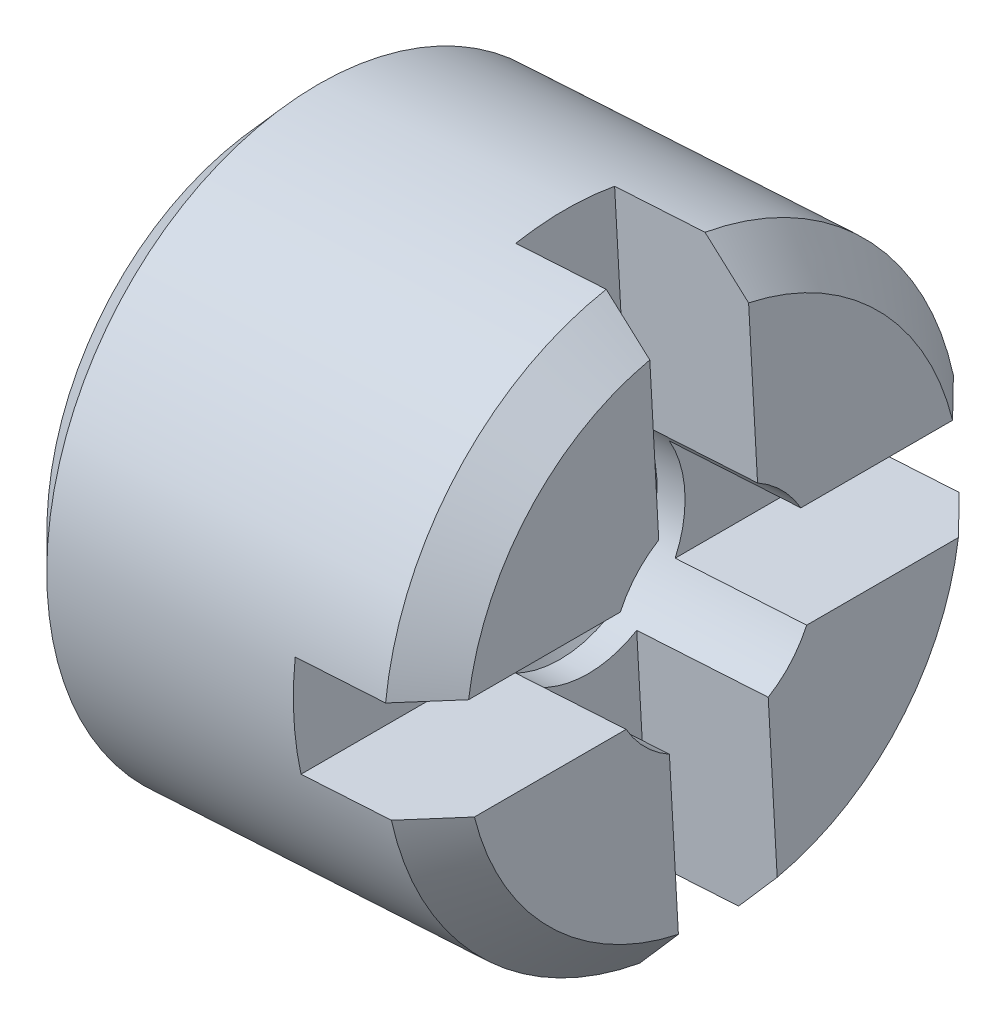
ISO-10303-21;
HEADER;
FILE_DESCRIPTION(('STEP AP214'),'2;1');
FILE_NAME('part.step','',(''),(''),'','','');
FILE_SCHEMA(('AUTOMOTIVE_DESIGN { 1 0 10303 214 1 1 1 1 }'));
ENDSEC;
DATA;
#1=APPLICATION_CONTEXT('core data for automotive mechanical design processes');
#2=APPLICATION_PROTOCOL_DEFINITION('international standard','automotive_design',2000,#1);
#3=PRODUCT_CONTEXT('',#1,'mechanical');
#4=PRODUCT('Part','Part','',(#3));
#5=PRODUCT_RELATED_PRODUCT_CATEGORY('part','',(#4));
#6=PRODUCT_DEFINITION_FORMATION('','',#4);
#7=PRODUCT_DEFINITION_CONTEXT('part definition',#1,'design');
#8=PRODUCT_DEFINITION('design','',#6,#7);
#9=PRODUCT_DEFINITION_SHAPE('','',#8);
#10=(LENGTH_UNIT() NAMED_UNIT(*) SI_UNIT(.MILLI.,.METRE.));
#11=(NAMED_UNIT(*) PLANE_ANGLE_UNIT() SI_UNIT($,.RADIAN.));
#12=(NAMED_UNIT(*) SI_UNIT($,.STERADIAN.) SOLID_ANGLE_UNIT());
#13=UNCERTAINTY_MEASURE_WITH_UNIT(LENGTH_MEASURE(1.E-05),#10,'distance_accuracy_value','');
#14=(GEOMETRIC_REPRESENTATION_CONTEXT(3) GLOBAL_UNCERTAINTY_ASSIGNED_CONTEXT((#13)) GLOBAL_UNIT_ASSIGNED_CONTEXT((#10,
#11,#12)) REPRESENTATION_CONTEXT('',''));
#15=CARTESIAN_POINT('',(0.,0.,0.));
#16=DIRECTION('',(0.,0.,1.));
#17=DIRECTION('',(1.,0.,0.));
#18=AXIS2_PLACEMENT_3D('',#15,#16,#17);
#19=CARTESIAN_POINT('',(13.2898777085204,21.6295561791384,0.));
#20=DIRECTION('',(0.998253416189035,0.0590772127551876,0.));
#21=DIRECTION('',(-0.0590772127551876,0.998253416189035,0.));
#22=AXIS2_PLACEMENT_3D('',#19,#20,#21);
#23=CONICAL_SURFACE('',#22,1.2499999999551,1.04719754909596);
#24=CARTESIAN_POINT('',(13.2898777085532,21.6295561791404,0.));
#25=DIRECTION('',(-0.998253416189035,-0.059077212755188,0.));
#26=DIRECTION('',(0.059077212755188,-0.998253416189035,0.));
#27=AXIS2_PLACEMENT_3D('',#24,#25,#26);
#28=CIRCLE('',#27,1.25);
#29=CARTESIAN_POINT('',(13.3637242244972,20.3817394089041,0.));
#30=VERTEX_POINT('',#29);
#31=EDGE_CURVE('E417',#30,#30,#28,.F.);
#32=ORIENTED_EDGE('',*,*,#31,.T.);
#33=EDGE_LOOP('',(#32));
#34=FACE_BOUND('',#33,.T.);
#35=CARTESIAN_POINT('',(12.569450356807,21.5869208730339,0.));
#36=VERTEX_POINT('',#35);
#37=VERTEX_LOOP('',#36);
#38=FACE_BOUND('',#37,.T.);
#39=ADVANCED_FACE('F16',(#34,#38),#23,.F.);
#40=CARTESIAN_POINT('',(14.2593140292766,21.6869279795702,0.));
#41=DIRECTION('',(-0.998253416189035,-0.059077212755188,0.));
#42=DIRECTION('',(0.059077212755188,-0.998253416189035,0.));
#43=AXIS2_PLACEMENT_3D('',#40,#41,#42);
#44=CYLINDRICAL_SURFACE('',#43,1.25);
#45=DIRECTION('',(-0.998253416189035,-0.059077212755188,0.));
#46=VECTOR('',#45,1.);
#47=CARTESIAN_POINT('',(14.1945308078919,22.7815983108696,-0.599999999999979));
#48=LINE('',#47,#46);
#49=CARTESIAN_POINT('',(13.5667616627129,22.7444465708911,-0.599999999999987));
#50=VERTEX_POINT('',#49);
#51=CARTESIAN_POINT('',(15.1639671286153,22.8389701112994,-0.599999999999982));
#52=VERTEX_POINT('',#51);
#53=EDGE_CURVE('E165',#50,#52,#48,.F.);
#54=ORIENTED_EDGE('',*,*,#53,.F.);
#55=CARTESIAN_POINT('',(13.6315448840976,21.6497762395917,0.));
#56=DIRECTION('',(-0.998253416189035,-0.059077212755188,0.));
#57=DIRECTION('',(0.059077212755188,-0.998253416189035,0.));
#58=AXIS2_PLACEMENT_3D('',#55,#56,#57);
#59=CIRCLE('',#58,1.25);
#60=CARTESIAN_POINT('',(13.5667616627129,22.7444465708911,0.600000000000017));
#61=VERTEX_POINT('',#60);
#62=EDGE_CURVE('E416',#61,#50,#59,.T.);
#63=ORIENTED_EDGE('',*,*,#62,.F.);
#64=DIRECTION('',(-0.998253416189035,-0.059077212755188,0.));
#65=VECTOR('',#64,1.);
#66=CARTESIAN_POINT('',(14.1945308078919,22.7815983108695,0.600000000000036));
#67=LINE('',#66,#65);
#68=CARTESIAN_POINT('',(15.1639671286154,22.8389701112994,0.600000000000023));
#69=VERTEX_POINT('',#68);
#70=EDGE_CURVE('E414',#69,#61,#67,.T.);
#71=ORIENTED_EDGE('',*,*,#70,.F.);
#72=CARTESIAN_POINT('',(15.22875035,21.74429978,0.));
#73=DIRECTION('',(-0.998253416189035,-0.059077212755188,0.));
#74=DIRECTION('',(0.059077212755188,-0.998253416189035,0.));
#75=AXIS2_PLACEMENT_3D('',#72,#73,#74);
#76=CIRCLE('',#75,1.25);
#77=CARTESIAN_POINT('',(15.1933040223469,22.3432518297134,1.09658560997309));
#78=VERTEX_POINT('',#77);
#79=EDGE_CURVE('E412',#78,#69,#76,.T.);
#80=ORIENTED_EDGE('',*,*,#79,.F.);
#81=DIRECTION('',(-0.998253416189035,-0.059077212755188,0.));
#82=VECTOR('',#81,1.);
#83=CARTESIAN_POINT('',(14.2238677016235,22.2858800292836,1.09658560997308));
#84=LINE('',#83,#82);
#85=CARTESIAN_POINT('',(13.5960985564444,22.2487282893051,1.09658560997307));
#86=VERTEX_POINT('',#85);
#87=EDGE_CURVE('E410',#86,#78,#84,.F.);
#88=ORIENTED_EDGE('',*,*,#87,.F.);
#89=CARTESIAN_POINT('',(13.6315448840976,21.6497762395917,0.));
#90=DIRECTION('',(-0.998253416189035,-0.059077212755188,0.));
#91=DIRECTION('',(0.059077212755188,-0.998253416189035,0.));
#92=AXIS2_PLACEMENT_3D('',#89,#90,#91);
#93=CIRCLE('',#92,1.25);
#94=CARTESIAN_POINT('',(13.6669912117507,21.0508241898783,1.09658560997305));
#95=VERTEX_POINT('',#94);
#96=EDGE_CURVE('E419',#95,#86,#93,.T.);
#97=ORIENTED_EDGE('',*,*,#96,.F.);
#98=DIRECTION('',(-0.998253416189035,-0.059077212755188,0.));
#99=VECTOR('',#98,1.);
#100=CARTESIAN_POINT('',(14.4655939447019,21.0980859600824,1.09658560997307));
#101=LINE('',#100,#99);
#102=CARTESIAN_POINT('',(15.2641966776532,21.1453477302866,1.09658560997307));
#103=VERTEX_POINT('',#102);
#104=EDGE_CURVE('E386',#103,#95,#101,.T.);
#105=ORIENTED_EDGE('',*,*,#104,.F.);
#106=CARTESIAN_POINT('',(15.22875035,21.74429978,0.));
#107=DIRECTION('',(-0.998253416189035,-0.059077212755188,0.));
#108=DIRECTION('',(0.059077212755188,-0.998253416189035,0.));
#109=AXIS2_PLACEMENT_3D('',#106,#107,#108);
#110=CIRCLE('',#109,1.25);
#111=CARTESIAN_POINT('',(15.2935335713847,20.6496294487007,0.60000000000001));
#112=VERTEX_POINT('',#111);
#113=EDGE_CURVE('E413',#112,#103,#110,.T.);
#114=ORIENTED_EDGE('',*,*,#113,.F.);
#115=DIRECTION('',(0.998253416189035,0.0590772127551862,0.));
#116=VECTOR('',#115,1.);
#117=CARTESIAN_POINT('',(13.6963281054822,20.5551059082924,0.60000000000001));
#118=LINE('',#117,#116);
#119=CARTESIAN_POINT('',(13.6963281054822,20.5551059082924,0.60000000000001));
#120=VERTEX_POINT('',#119);
#121=EDGE_CURVE('E326',#120,#112,#118,.T.);
#122=ORIENTED_EDGE('',*,*,#121,.F.);
#123=CARTESIAN_POINT('',(13.6315448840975,21.6497762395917,0.));
#124=DIRECTION('',(-0.998253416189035,-0.059077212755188,0.));
#125=DIRECTION('',(0.059077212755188,-0.998253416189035,0.));
#126=AXIS2_PLACEMENT_3D('',#123,#124,#125);
#127=CIRCLE('',#126,1.25);
#128=CARTESIAN_POINT('',(13.6963281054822,20.5551059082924,-0.599999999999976));
#129=VERTEX_POINT('',#128);
#130=EDGE_CURVE('E420',#129,#120,#127,.T.);
#131=ORIENTED_EDGE('',*,*,#130,.F.);
#132=DIRECTION('',(-0.998253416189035,-0.059077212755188,0.));
#133=VECTOR('',#132,1.);
#134=CARTESIAN_POINT('',(14.3240972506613,20.5922576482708,-0.599999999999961));
#135=LINE('',#134,#133);
#136=CARTESIAN_POINT('',(15.2935335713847,20.6496294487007,-0.599999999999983));
#137=VERTEX_POINT('',#136);
#138=EDGE_CURVE('E366',#137,#129,#135,.T.);
#139=ORIENTED_EDGE('',*,*,#138,.F.);
#140=CARTESIAN_POINT('',(15.22875035,21.74429978,0.));
#141=DIRECTION('',(-0.998253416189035,-0.059077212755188,0.));
#142=DIRECTION('',(0.059077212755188,-0.998253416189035,0.));
#143=AXIS2_PLACEMENT_3D('',#140,#141,#142);
#144=CIRCLE('',#143,1.25);
#145=CARTESIAN_POINT('',(15.2641966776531,21.1453477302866,-1.09658560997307));
#146=VERTEX_POINT('',#145);
#147=EDGE_CURVE('E421',#146,#137,#144,.T.);
#148=ORIENTED_EDGE('',*,*,#147,.F.);
#149=DIRECTION('',(-0.998253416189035,-0.059077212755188,0.));
#150=VECTOR('',#149,1.);
#151=CARTESIAN_POINT('',(14.2947603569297,21.0879759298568,-1.09658560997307));
#152=LINE('',#151,#150);
#153=CARTESIAN_POINT('',(13.6669912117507,21.0508241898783,-1.09658560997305));
#154=VERTEX_POINT('',#153);
#155=EDGE_CURVE('E180',#154,#146,#152,.F.);
#156=ORIENTED_EDGE('',*,*,#155,.F.);
#157=CARTESIAN_POINT('',(13.6315448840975,21.6497762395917,0.));
#158=DIRECTION('',(-0.998253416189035,-0.059077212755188,0.));
#159=DIRECTION('',(0.059077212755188,-0.998253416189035,0.));
#160=AXIS2_PLACEMENT_3D('',#157,#158,#159);
#161=CIRCLE('',#160,1.25);
#162=CARTESIAN_POINT('',(13.5960985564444,22.2487282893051,-1.09658560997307));
#163=VERTEX_POINT('',#162);
#164=EDGE_CURVE('E178',#163,#154,#161,.T.);
#165=ORIENTED_EDGE('',*,*,#164,.F.);
#166=DIRECTION('',(-0.998253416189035,-0.059077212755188,0.));
#167=VECTOR('',#166,1.);
#168=CARTESIAN_POINT('',(14.2238677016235,22.2858800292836,-1.09658560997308));
#169=LINE('',#168,#167);
#170=CARTESIAN_POINT('',(15.1933040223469,22.3432518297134,-1.09658560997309));
#171=VERTEX_POINT('',#170);
#172=EDGE_CURVE('E164',#171,#163,#169,.T.);
#173=ORIENTED_EDGE('',*,*,#172,.F.);
#174=CARTESIAN_POINT('',(15.22875035,21.74429978,0.));
#175=DIRECTION('',(-0.998253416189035,-0.059077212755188,0.));
#176=DIRECTION('',(0.059077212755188,-0.998253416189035,0.));
#177=AXIS2_PLACEMENT_3D('',#174,#175,#176);
#178=CIRCLE('',#177,1.25);
#179=EDGE_CURVE('E19',#52,#171,#178,.T.);
#180=ORIENTED_EDGE('',*,*,#179,.F.);
#181=EDGE_LOOP('',(#54,#63,#71,#80,#88,#97,#105,#114,#122,#131,#139,#148,#156,#165,#173,#180));
#182=FACE_BOUND('',#181,.T.);
#183=ORIENTED_EDGE('',*,*,#31,.F.);
#184=EDGE_LOOP('',(#183));
#185=FACE_BOUND('',#184,.T.);
#186=ADVANCED_FACE('F175',(#182,#185),#44,.F.);
#187=CARTESIAN_POINT('',(13.6315448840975,21.6497762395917,0.));
#188=DIRECTION('',(0.998253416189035,0.059077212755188,0.));
#189=DIRECTION('',(-0.059077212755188,0.998253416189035,0.));
#190=AXIS2_PLACEMENT_3D('',#187,#188,#189);
#191=PLANE('',#190);
#192=CARTESIAN_POINT('',(13.6315448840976,21.6497762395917,0.));
#193=DIRECTION('',(-0.998253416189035,-0.059077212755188,0.));
#194=DIRECTION('',(0.059077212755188,-0.998253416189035,0.));
#195=AXIS2_PLACEMENT_3D('',#192,#193,#194);
#196=CIRCLE('',#195,3.5);
#197=CARTESIAN_POINT('',(13.5960985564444,22.2487282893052,3.44818792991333));
#198=VERTEX_POINT('',#197);
#199=CARTESIAN_POINT('',(13.6669912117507,21.0508241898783,3.44818792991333));
#200=VERTEX_POINT('',#199);
#201=EDGE_CURVE('E327',#198,#200,#196,.F.);
#202=ORIENTED_EDGE('',*,*,#201,.T.);
#203=DIRECTION('',(0.,0.,1.));
#204=VECTOR('',#203,1.);
#205=CARTESIAN_POINT('',(13.6669912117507,21.0508241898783,0.));
#206=LINE('',#205,#204);
#207=EDGE_CURVE('E389',#95,#200,#206,.T.);
#208=ORIENTED_EDGE('',*,*,#207,.F.);
#209=ORIENTED_EDGE('',*,*,#96,.T.);
#210=DIRECTION('',(0.,0.,1.));
#211=VECTOR('',#210,1.);
#212=CARTESIAN_POINT('',(13.5960985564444,22.2487282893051,0.));
#213=LINE('',#212,#211);
#214=EDGE_CURVE('E398',#198,#86,#213,.F.);
#215=ORIENTED_EDGE('',*,*,#214,.F.);
#216=EDGE_LOOP('',(#202,#208,#209,#215));
#217=FACE_BOUND('',#216,.T.);
#218=ADVANCED_FACE('F334',(#217),#191,.T.);
#219=CARTESIAN_POINT('',(14.4301476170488,21.6970380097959,0.60000000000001));
#220=DIRECTION('',(0.,0.,-1.));
#221=DIRECTION('',(-1.,0.,0.));
#222=AXIS2_PLACEMENT_3D('',#219,#220,#221);
#223=PLANE('',#222);
#224=DIRECTION('',(-0.998253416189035,-0.0590772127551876,0.));
#225=VECTOR('',#224,1.);
#226=CARTESIAN_POINT('',(14.9333329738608,18.2725957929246,0.60000000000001));
#227=LINE('',#226,#225);
#228=CARTESIAN_POINT('',(14.9333329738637,18.2725957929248,0.60000000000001));
#229=VERTEX_POINT('',#228);
#230=CARTESIAN_POINT('',(13.8352542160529,18.2076108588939,0.60000000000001));
#231=VERTEX_POINT('',#230);
#232=EDGE_CURVE('E325',#229,#231,#227,.T.);
#233=ORIENTED_EDGE('',*,*,#232,.T.);
#234=DIRECTION('',(-0.059077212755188,0.998253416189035,0.));
#235=VECTOR('',#234,1.);
#236=CARTESIAN_POINT('',(13.6315448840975,21.6497762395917,0.60000000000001));
#237=LINE('',#236,#235);
#238=EDGE_CURVE('E370',#120,#231,#237,.F.);
#239=ORIENTED_EDGE('',*,*,#238,.F.);
#240=ORIENTED_EDGE('',*,*,#121,.T.);
#241=DIRECTION('',(-0.059077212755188,0.998253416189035,0.));
#242=VECTOR('',#241,1.);
#243=CARTESIAN_POINT('',(15.3542894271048,19.6230112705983,0.60000000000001));
#244=LINE('',#243,#242);
#245=CARTESIAN_POINT('',(15.402401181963,18.8100459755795,0.60000000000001));
#246=VERTEX_POINT('',#245);
#247=EDGE_CURVE('E457',#246,#112,#244,.T.);
#248=ORIENTED_EDGE('',*,*,#247,.F.);
#249=CARTESIAN_POINT('',(15.4024011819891,18.8100459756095,0.60000000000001));
#250=CARTESIAN_POINT('',(15.324345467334,18.720364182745,0.60000000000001));
#251=CARTESIAN_POINT('',(15.2462285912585,18.6307357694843,0.60000000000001));
#252=CARTESIAN_POINT('',(15.0898725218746,18.4515857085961,0.60000000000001));
#253=CARTESIAN_POINT('',(15.011633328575,18.3620640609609,0.60000000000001));
#254=CARTESIAN_POINT('',(14.9333329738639,18.2725957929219,0.60000000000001));
#255=B_SPLINE_CURVE_WITH_KNOTS('',3,(#249,#250,#251,#252,#253,#254),.UNSPECIFIED.,.F.,.F.,(4,2,
4),(0.,0.356678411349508,0.713356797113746),.UNSPECIFIED.);
#256=EDGE_CURVE('E318',#246,#229,#255,.T.);
#257=ORIENTED_EDGE('',*,*,#256,.T.);
#258=EDGE_LOOP('',(#233,#239,#240,#248,#257));
#259=FACE_BOUND('',#258,.T.);
#260=ADVANCED_FACE('F329',(#259),#223,.T.);
#261=CARTESIAN_POINT('',(14.4655939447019,21.0980859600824,0.));
#262=DIRECTION('',(-0.059077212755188,0.998253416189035,0.));
#263=DIRECTION('',(-0.998253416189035,-0.059077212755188,0.));
#264=AXIS2_PLACEMENT_3D('',#261,#262,#263);
#265=PLANE('',#264);
#266=CARTESIAN_POINT('',(14.7650699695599,21.115809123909,3.44818792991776));
#267=CARTESIAN_POINT('',(14.8483733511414,21.1207390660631,3.36350169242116));
#268=CARTESIAN_POINT('',(14.9316189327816,21.1256655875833,3.27875855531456));
#269=CARTESIAN_POINT('',(15.0979945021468,21.1355117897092,3.10915847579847));
#270=CARTESIAN_POINT('',(15.1811244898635,21.1404314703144,3.02430153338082));
#271=CARTESIAN_POINT('',(15.2641966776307,21.1453477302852,2.93938769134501));
#272=B_SPLINE_CURVE_WITH_KNOTS('',3,(#266,#267,#268,#269,#270,#271),.UNSPECIFIED.,.F.,.F.,(4,2,
4),(0.,0.356678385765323,0.713356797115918),.UNSPECIFIED.);
#273=CARTESIAN_POINT('',(14.7650699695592,21.115809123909,3.44818792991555));
#274=VERTEX_POINT('',#273);
#275=CARTESIAN_POINT('',(15.2641966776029,21.1453477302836,2.93938769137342));
#276=VERTEX_POINT('',#275);
#277=EDGE_CURVE('E313',#274,#276,#272,.T.);
#278=ORIENTED_EDGE('',*,*,#277,.T.);
#279=DIRECTION('',(0.,0.,1.));
#280=VECTOR('',#279,1.);
#281=CARTESIAN_POINT('',(15.2641966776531,21.1453477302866,0.));
#282=LINE('',#281,#280);
#283=EDGE_CURVE('E441',#103,#276,#282,.T.);
#284=ORIENTED_EDGE('',*,*,#283,.F.);
#285=ORIENTED_EDGE('',*,*,#104,.T.);
#286=ORIENTED_EDGE('',*,*,#207,.T.);
#287=DIRECTION('',(-0.998253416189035,-0.059077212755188,0.));
#288=VECTOR('',#287,1.);
#289=CARTESIAN_POINT('',(14.4655939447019,21.0980859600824,3.44818792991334));
#290=LINE('',#289,#288);
#291=EDGE_CURVE('E405',#200,#274,#290,.F.);
#292=ORIENTED_EDGE('',*,*,#291,.T.);
#293=EDGE_LOOP('',(#278,#284,#285,#286,#292));
#294=FACE_BOUND('',#293,.T.);
#295=ADVANCED_FACE('F333',(#294),#265,.T.);
#296=CARTESIAN_POINT('',(14.4301476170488,21.6970380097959,0.60000000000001));
#297=DIRECTION('',(0.,0.,-1.));
#298=DIRECTION('',(-1.,0.,0.));
#299=AXIS2_PLACEMENT_3D('',#296,#297,#298);
#300=PLANE('',#299);
#301=CARTESIAN_POINT('',(14.5259143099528,25.1569265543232,0.60000000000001));
#302=CARTESIAN_POINT('',(14.614220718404,25.0773181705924,0.60000000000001));
#303=CARTESIAN_POINT('',(14.7024726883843,24.9976495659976,0.60000000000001));
#304=CARTESIAN_POINT('',(14.8788677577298,24.8381919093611,0.60000000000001));
#305=CARTESIAN_POINT('',(14.9670108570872,24.7584028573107,0.60000000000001));
#306=CARTESIAN_POINT('',(15.055099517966,24.6785535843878,0.60000000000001));
#307=B_SPLINE_CURVE_WITH_KNOTS('',3,(#301,#302,#303,#304,#305,#306),.UNSPECIFIED.,.F.,.F.,(4,2,
4),(0.,0.356678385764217,0.713356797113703),.UNSPECIFIED.);
#308=CARTESIAN_POINT('',(14.5259143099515,25.1569265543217,0.60000000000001));
#309=VERTEX_POINT('',#308);
#310=CARTESIAN_POINT('',(15.0550995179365,24.6785535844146,0.60000000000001));
#311=VERTEX_POINT('',#310);
#312=EDGE_CURVE('E294',#309,#311,#307,.T.);
#313=ORIENTED_EDGE('',*,*,#312,.T.);
#314=DIRECTION('',(-0.059077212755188,0.998253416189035,0.));
#315=VECTOR('',#314,1.);
#316=CARTESIAN_POINT('',(15.3542894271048,19.6230112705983,0.60000000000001));
#317=LINE('',#316,#315);
#318=EDGE_CURVE('E450',#69,#311,#317,.T.);
#319=ORIENTED_EDGE('',*,*,#318,.F.);
#320=ORIENTED_EDGE('',*,*,#70,.T.);
#321=DIRECTION('',(-0.059077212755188,0.998253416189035,0.));
#322=VECTOR('',#321,1.);
#323=CARTESIAN_POINT('',(13.6315448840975,21.6497762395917,0.60000000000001));
#324=LINE('',#323,#322);
#325=CARTESIAN_POINT('',(13.4278355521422,25.0919416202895,0.60000000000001));
#326=VERTEX_POINT('',#325);
#327=EDGE_CURVE('E373',#326,#61,#324,.F.);
#328=ORIENTED_EDGE('',*,*,#327,.F.);
#329=DIRECTION('',(0.998253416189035,0.0590772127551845,0.));
#330=VECTOR('',#329,1.);
#331=CARTESIAN_POINT('',(13.4278355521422,25.0919416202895,0.60000000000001));
#332=LINE('',#331,#330);
#333=EDGE_CURVE('E393',#326,#309,#332,.T.);
#334=ORIENTED_EDGE('',*,*,#333,.T.);
#335=EDGE_LOOP('',(#313,#319,#320,#328,#334));
#336=FACE_BOUND('',#335,.T.);
#337=ADVANCED_FACE('F280',(#336),#300,.T.);
#338=CARTESIAN_POINT('',(14.3947012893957,22.2959900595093,0.));
#339=DIRECTION('',(0.059077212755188,-0.998253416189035,0.));
#340=DIRECTION('',(0.998253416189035,0.059077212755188,0.));
#341=AXIS2_PLACEMENT_3D('',#338,#339,#340);
#342=PLANE('',#341);
#343=DIRECTION('',(0.998253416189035,0.059077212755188,0.));
#344=VECTOR('',#343,1.);
#345=CARTESIAN_POINT('',(14.3947012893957,22.2959900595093,3.44818792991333));
#346=LINE('',#345,#344);
#347=CARTESIAN_POINT('',(14.6941773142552,22.313713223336,3.44818792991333));
#348=VERTEX_POINT('',#347);
#349=EDGE_CURVE('E293',#348,#198,#346,.F.);
#350=ORIENTED_EDGE('',*,*,#349,.T.);
#351=ORIENTED_EDGE('',*,*,#214,.T.);
#352=ORIENTED_EDGE('',*,*,#87,.T.);
#353=DIRECTION('',(0.,0.,1.));
#354=VECTOR('',#353,1.);
#355=CARTESIAN_POINT('',(15.1933040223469,22.3432518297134,0.));
#356=LINE('',#355,#354);
#357=CARTESIAN_POINT('',(15.1933040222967,22.3432518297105,2.93938769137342));
#358=VERTEX_POINT('',#357);
#359=EDGE_CURVE('E247',#358,#78,#356,.F.);
#360=ORIENTED_EDGE('',*,*,#359,.F.);
#361=CARTESIAN_POINT('',(15.1933040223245,22.3432518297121,2.939387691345));
#362=CARTESIAN_POINT('',(15.1102318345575,22.3383355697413,3.02430153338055));
#363=CARTESIAN_POINT('',(15.0271018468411,22.3334158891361,3.10915847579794));
#364=CARTESIAN_POINT('',(14.8607262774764,22.3235696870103,3.2787585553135));
#365=CARTESIAN_POINT('',(14.7774806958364,22.3186431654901,3.36350169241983));
#366=CARTESIAN_POINT('',(14.6941773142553,22.313713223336,3.44818792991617));
#367=B_SPLINE_CURVE_WITH_KNOTS('',3,(#361,#362,#363,#364,#365,#366),.UNSPECIFIED.,.F.,.F.,(4,2,
4),(0.,0.356678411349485,0.7133567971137),.UNSPECIFIED.);
#368=EDGE_CURVE('E285',#358,#348,#367,.T.);
#369=ORIENTED_EDGE('',*,*,#368,.T.);
#370=EDGE_LOOP('',(#350,#351,#352,#360,#369));
#371=FACE_BOUND('',#370,.T.);
#372=ADVANCED_FACE('F275',(#371),#342,.T.);
#373=CARTESIAN_POINT('',(13.6315448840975,21.6497762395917,0.));
#374=DIRECTION('',(0.998253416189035,0.059077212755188,0.));
#375=DIRECTION('',(-0.059077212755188,0.998253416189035,0.));
#376=AXIS2_PLACEMENT_3D('',#373,#374,#375);
#377=PLANE('',#376);
#378=ORIENTED_EDGE('',*,*,#327,.T.);
#379=ORIENTED_EDGE('',*,*,#62,.T.);
#380=DIRECTION('',(0.0590772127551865,-0.998253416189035,0.));
#381=VECTOR('',#380,1.);
#382=CARTESIAN_POINT('',(13.4278355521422,25.0919416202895,-0.59999999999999));
#383=LINE('',#382,#381);
#384=CARTESIAN_POINT('',(13.4278355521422,25.0919416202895,-0.59999999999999));
#385=VERTEX_POINT('',#384);
#386=EDGE_CURVE('E379',#385,#50,#383,.T.);
#387=ORIENTED_EDGE('',*,*,#386,.F.);
#388=CARTESIAN_POINT('',(13.6315448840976,21.6497762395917,0.));
#389=DIRECTION('',(-0.998253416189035,-0.059077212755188,0.));
#390=DIRECTION('',(0.059077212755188,-0.998253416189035,0.));
#391=AXIS2_PLACEMENT_3D('',#388,#389,#390);
#392=CIRCLE('',#391,3.5);
#393=EDGE_CURVE('E295',#385,#326,#392,.F.);
#394=ORIENTED_EDGE('',*,*,#393,.T.);
#395=EDGE_LOOP('',(#378,#379,#387,#394));
#396=FACE_BOUND('',#395,.T.);
#397=ADVANCED_FACE('F271',(#396),#377,.T.);
#398=CARTESIAN_POINT('',(13.6315448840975,21.6497762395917,0.));
#399=DIRECTION('',(0.998253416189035,0.059077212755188,0.));
#400=DIRECTION('',(-0.059077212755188,0.998253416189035,0.));
#401=AXIS2_PLACEMENT_3D('',#398,#399,#400);
#402=PLANE('',#401);
#403=DIRECTION('',(0.0590772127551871,-0.998253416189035,0.));
#404=VECTOR('',#403,1.);
#405=CARTESIAN_POINT('',(13.6963281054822,20.5551059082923,-0.59999999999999));
#406=LINE('',#405,#404);
#407=CARTESIAN_POINT('',(13.8352542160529,18.2076108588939,-0.59999999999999));
#408=VERTEX_POINT('',#407);
#409=EDGE_CURVE('E359',#129,#408,#406,.T.);
#410=ORIENTED_EDGE('',*,*,#409,.F.);
#411=ORIENTED_EDGE('',*,*,#130,.T.);
#412=ORIENTED_EDGE('',*,*,#238,.T.);
#413=CARTESIAN_POINT('',(13.6315448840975,21.6497762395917,0.));
#414=DIRECTION('',(-0.998253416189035,-0.059077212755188,0.));
#415=DIRECTION('',(0.059077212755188,-0.998253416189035,0.));
#416=AXIS2_PLACEMENT_3D('',#413,#414,#415);
#417=CIRCLE('',#416,3.5);
#418=EDGE_CURVE('E356',#231,#408,#417,.F.);
#419=ORIENTED_EDGE('',*,*,#418,.T.);
#420=EDGE_LOOP('',(#410,#411,#412,#419));
#421=FACE_BOUND('',#420,.T.);
#422=ADVANCED_FACE('F267',(#421),#402,.T.);
#423=CARTESIAN_POINT('',(13.6315448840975,21.6497762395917,0.));
#424=DIRECTION('',(0.998253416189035,0.059077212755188,0.));
#425=DIRECTION('',(-0.059077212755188,0.998253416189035,0.));
#426=AXIS2_PLACEMENT_3D('',#423,#424,#425);
#427=PLANE('',#426);
#428=CARTESIAN_POINT('',(13.6315448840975,21.6497762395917,0.));
#429=DIRECTION('',(-0.998253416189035,-0.059077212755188,0.));
#430=DIRECTION('',(0.059077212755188,-0.998253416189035,0.));
#431=AXIS2_PLACEMENT_3D('',#428,#429,#430);
#432=CIRCLE('',#431,3.5);
#433=CARTESIAN_POINT('',(13.6669912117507,21.0508241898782,-3.44818792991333));
#434=VERTEX_POINT('',#433);
#435=CARTESIAN_POINT('',(13.5960985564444,22.2487282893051,-3.44818792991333));
#436=VERTEX_POINT('',#435);
#437=EDGE_CURVE('E248',#434,#436,#432,.F.);
#438=ORIENTED_EDGE('',*,*,#437,.T.);
#439=DIRECTION('',(0.,0.,1.));
#440=VECTOR('',#439,1.);
#441=CARTESIAN_POINT('',(13.5960985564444,22.2487282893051,0.));
#442=LINE('',#441,#440);
#443=EDGE_CURVE('E377',#163,#436,#442,.F.);
#444=ORIENTED_EDGE('',*,*,#443,.F.);
#445=ORIENTED_EDGE('',*,*,#164,.T.);
#446=DIRECTION('',(0.,0.,1.));
#447=VECTOR('',#446,1.);
#448=CARTESIAN_POINT('',(13.6669912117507,21.0508241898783,0.));
#449=LINE('',#448,#447);
#450=EDGE_CURVE('E202',#434,#154,#449,.T.);
#451=ORIENTED_EDGE('',*,*,#450,.F.);
#452=EDGE_LOOP('',(#438,#444,#445,#451));
#453=FACE_BOUND('',#452,.T.);
#454=ADVANCED_FACE('F263',(#453),#427,.T.);
#455=CARTESIAN_POINT('',(15.3542894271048,19.6230112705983,0.));
#456=DIRECTION('',(0.998253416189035,0.059077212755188,0.));
#457=DIRECTION('',(-0.059077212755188,0.998253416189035,0.));
#458=AXIS2_PLACEMENT_3D('',#455,#456,#457);
#459=PLANE('',#458);
#460=ORIENTED_EDGE('',*,*,#283,.T.);
#461=CARTESIAN_POINT('',(15.228750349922,21.7442997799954,0.));
#462=DIRECTION('',(-0.998253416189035,-0.0590772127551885,0.));
#463=DIRECTION('',(0.0590772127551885,-0.998253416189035,0.));
#464=AXIS2_PLACEMENT_3D('',#461,#462,#463);
#465=CIRCLE('',#464,3.00000000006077);
#466=EDGE_CURVE('E199',#246,#276,#465,.T.);
#467=ORIENTED_EDGE('',*,*,#466,.F.);
#468=ORIENTED_EDGE('',*,*,#247,.T.);
#469=ORIENTED_EDGE('',*,*,#113,.T.);
#470=EDGE_LOOP('',(#460,#467,#468,#469));
#471=FACE_BOUND('',#470,.T.);
#472=ADVANCED_FACE('F259',(#471),#459,.T.);
#473=CARTESIAN_POINT('',(15.3542894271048,19.6230112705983,0.));
#474=DIRECTION('',(0.998253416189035,0.059077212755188,0.));
#475=DIRECTION('',(-0.059077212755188,0.998253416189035,0.));
#476=AXIS2_PLACEMENT_3D('',#473,#474,#475);
#477=PLANE('',#476);
#478=ORIENTED_EDGE('',*,*,#359,.T.);
#479=ORIENTED_EDGE('',*,*,#79,.T.);
#480=ORIENTED_EDGE('',*,*,#318,.T.);
#481=CARTESIAN_POINT('',(15.228750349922,21.7442997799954,0.));
#482=DIRECTION('',(-0.998253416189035,-0.0590772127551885,0.));
#483=DIRECTION('',(0.0590772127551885,-0.998253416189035,0.));
#484=AXIS2_PLACEMENT_3D('',#481,#482,#483);
#485=CIRCLE('',#484,3.00000000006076);
#486=EDGE_CURVE('E196',#358,#311,#485,.T.);
#487=ORIENTED_EDGE('',*,*,#486,.F.);
#488=EDGE_LOOP('',(#478,#479,#480,#487));
#489=FACE_BOUND('',#488,.T.);
#490=ADVANCED_FACE('F254',(#489),#477,.T.);
#491=CARTESIAN_POINT('',(14.4301476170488,21.6970380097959,-0.59999999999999));
#492=DIRECTION('',(0.,0.,1.));
#493=DIRECTION('',(1.,0.,0.));
#494=AXIS2_PLACEMENT_3D('',#491,#492,#493);
#495=PLANE('',#494);
#496=DIRECTION('',(-0.998253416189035,-0.0590772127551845,0.));
#497=VECTOR('',#496,1.);
#498=CARTESIAN_POINT('',(14.5259143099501,25.1569265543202,-0.59999999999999));
#499=LINE('',#498,#497);
#500=CARTESIAN_POINT('',(14.525914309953,25.1569265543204,-0.59999999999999));
#501=VERTEX_POINT('',#500);
#502=EDGE_CURVE('E246',#501,#385,#499,.T.);
#503=ORIENTED_EDGE('',*,*,#502,.T.);
#504=ORIENTED_EDGE('',*,*,#386,.T.);
#505=ORIENTED_EDGE('',*,*,#53,.T.);
#506=DIRECTION('',(-0.059077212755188,0.998253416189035,0.));
#507=VECTOR('',#506,1.);
#508=CARTESIAN_POINT('',(15.3542894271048,19.6230112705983,-0.59999999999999));
#509=LINE('',#508,#507);
#510=CARTESIAN_POINT('',(15.0550995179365,24.6785535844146,-0.59999999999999));
#511=VERTEX_POINT('',#510);
#512=EDGE_CURVE('E160',#511,#52,#509,.F.);
#513=ORIENTED_EDGE('',*,*,#512,.F.);
#514=CARTESIAN_POINT('',(15.055099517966,24.6785535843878,-0.59999999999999));
#515=CARTESIAN_POINT('',(14.9670108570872,24.7584028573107,-0.59999999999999));
#516=CARTESIAN_POINT('',(14.8788677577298,24.8381919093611,-0.59999999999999));
#517=CARTESIAN_POINT('',(14.7024726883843,24.9976495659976,-0.59999999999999));
#518=CARTESIAN_POINT('',(14.614220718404,25.0773181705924,-0.59999999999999));
#519=CARTESIAN_POINT('',(14.5259143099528,25.1569265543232,-0.59999999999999));
#520=B_SPLINE_CURVE_WITH_KNOTS('',3,(#514,#515,#516,#517,#518,#519),.UNSPECIFIED.,.F.,.F.,(4,2,
4),(0.,0.356678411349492,0.71335679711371),.UNSPECIFIED.);
#521=EDGE_CURVE('E239',#511,#501,#520,.T.);
#522=ORIENTED_EDGE('',*,*,#521,.T.);
#523=EDGE_LOOP('',(#503,#504,#505,#513,#522));
#524=FACE_BOUND('',#523,.T.);
#525=ADVANCED_FACE('F250',(#524),#495,.T.);
#526=CARTESIAN_POINT('',(14.3947012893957,22.2959900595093,0.));
#527=DIRECTION('',(0.059077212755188,-0.998253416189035,0.));
#528=DIRECTION('',(0.998253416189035,0.059077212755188,0.));
#529=AXIS2_PLACEMENT_3D('',#526,#527,#528);
#530=PLANE('',#529);
#531=CARTESIAN_POINT('',(14.6941773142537,22.3137132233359,-3.44818792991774));
#532=CARTESIAN_POINT('',(14.7774806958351,22.31864316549,-3.36350169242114));
#533=CARTESIAN_POINT('',(14.8607262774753,22.3235696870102,-3.27875855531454));
#534=CARTESIAN_POINT('',(15.0271018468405,22.3334158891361,-3.10915847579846));
#535=CARTESIAN_POINT('',(15.1102318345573,22.3383355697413,-3.02430153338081));
#536=CARTESIAN_POINT('',(15.1933040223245,22.3432518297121,-2.939387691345));
#537=B_SPLINE_CURVE_WITH_KNOTS('',3,(#531,#532,#533,#534,#535,#536),.UNSPECIFIED.,.F.,.F.,(4,2,
4),(0.,0.356678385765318,0.713356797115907),.UNSPECIFIED.);
#538=CARTESIAN_POINT('',(14.694177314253,22.3137132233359,-3.44818792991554));
#539=VERTEX_POINT('',#538);
#540=CARTESIAN_POINT('',(15.1933040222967,22.3432518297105,-2.93938769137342));
#541=VERTEX_POINT('',#540);
#542=EDGE_CURVE('E171',#539,#541,#537,.T.);
#543=ORIENTED_EDGE('',*,*,#542,.T.);
#544=DIRECTION('',(0.,0.,1.));
#545=VECTOR('',#544,1.);
#546=CARTESIAN_POINT('',(15.1933040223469,22.3432518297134,0.));
#547=LINE('',#546,#545);
#548=EDGE_CURVE('E157',#171,#541,#547,.F.);
#549=ORIENTED_EDGE('',*,*,#548,.F.);
#550=ORIENTED_EDGE('',*,*,#172,.T.);
#551=ORIENTED_EDGE('',*,*,#443,.T.);
#552=DIRECTION('',(0.998253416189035,0.059077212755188,0.));
#553=VECTOR('',#552,1.);
#554=CARTESIAN_POINT('',(14.3947012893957,22.2959900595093,-3.44818792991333));
#555=LINE('',#554,#553);
#556=EDGE_CURVE('E368',#436,#539,#555,.T.);
#557=ORIENTED_EDGE('',*,*,#556,.T.);
#558=EDGE_LOOP('',(#543,#549,#550,#551,#557));
#559=FACE_BOUND('',#558,.T.);
#560=ADVANCED_FACE('F167',(#559),#530,.T.);
#561=CARTESIAN_POINT('',(14.4301476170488,21.6970380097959,-0.59999999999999));
#562=DIRECTION('',(0.,0.,1.));
#563=DIRECTION('',(1.,0.,0.));
#564=AXIS2_PLACEMENT_3D('',#561,#562,#563);
#565=PLANE('',#564);
#566=CARTESIAN_POINT('',(14.9333329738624,18.2725957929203,-0.59999999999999));
#567=CARTESIAN_POINT('',(15.0116333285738,18.3620640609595,-0.59999999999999));
#568=CARTESIAN_POINT('',(15.0898725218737,18.451585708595,-0.59999999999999));
#569=CARTESIAN_POINT('',(15.246228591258,18.6307357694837,-0.59999999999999));
#570=CARTESIAN_POINT('',(15.3243454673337,18.7203641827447,-0.59999999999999));
#571=CARTESIAN_POINT('',(15.4024011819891,18.8100459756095,-0.59999999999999));
#572=B_SPLINE_CURVE_WITH_KNOTS('',3,(#566,#567,#568,#569,#570,#571),.UNSPECIFIED.,.F.,.F.,(4,2,
4),(0.,0.356678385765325,0.713356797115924),.UNSPECIFIED.);
#573=CARTESIAN_POINT('',(14.9333329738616,18.2725957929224,-0.59999999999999));
#574=VERTEX_POINT('',#573);
#575=CARTESIAN_POINT('',(15.402401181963,18.8100459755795,-0.59999999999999));
#576=VERTEX_POINT('',#575);
#577=EDGE_CURVE('E210',#574,#576,#572,.T.);
#578=ORIENTED_EDGE('',*,*,#577,.T.);
#579=DIRECTION('',(-0.059077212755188,0.998253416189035,0.));
#580=VECTOR('',#579,1.);
#581=CARTESIAN_POINT('',(15.3542894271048,19.6230112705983,-0.59999999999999));
#582=LINE('',#581,#580);
#583=EDGE_CURVE('E172',#137,#576,#582,.F.);
#584=ORIENTED_EDGE('',*,*,#583,.F.);
#585=ORIENTED_EDGE('',*,*,#138,.T.);
#586=ORIENTED_EDGE('',*,*,#409,.T.);
#587=DIRECTION('',(0.998253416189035,0.0590772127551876,0.));
#588=VECTOR('',#587,1.);
#589=CARTESIAN_POINT('',(13.8352542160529,18.2076108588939,-0.59999999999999));
#590=LINE('',#589,#588);
#591=EDGE_CURVE('E354',#408,#574,#590,.T.);
#592=ORIENTED_EDGE('',*,*,#591,.T.);
#593=EDGE_LOOP('',(#578,#584,#585,#586,#592));
#594=FACE_BOUND('',#593,.T.);
#595=ADVANCED_FACE('F363',(#594),#565,.T.);
#596=CARTESIAN_POINT('',(14.4655939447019,21.0980859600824,0.));
#597=DIRECTION('',(-0.059077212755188,0.998253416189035,0.));
#598=DIRECTION('',(-0.998253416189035,-0.059077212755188,0.));
#599=AXIS2_PLACEMENT_3D('',#596,#597,#598);
#600=PLANE('',#599);
#601=DIRECTION('',(-0.998253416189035,-0.059077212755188,0.));
#602=VECTOR('',#601,1.);
#603=CARTESIAN_POINT('',(14.4655939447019,21.0980859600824,-3.44818792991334));
#604=LINE('',#603,#602);
#605=CARTESIAN_POINT('',(14.7650699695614,21.1158091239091,-3.44818792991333));
#606=VERTEX_POINT('',#605);
#607=EDGE_CURVE('E209',#606,#434,#604,.T.);
#608=ORIENTED_EDGE('',*,*,#607,.T.);
#609=ORIENTED_EDGE('',*,*,#450,.T.);
#610=ORIENTED_EDGE('',*,*,#155,.T.);
#611=DIRECTION('',(0.,0.,1.));
#612=VECTOR('',#611,1.);
#613=CARTESIAN_POINT('',(15.2641966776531,21.1453477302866,0.));
#614=LINE('',#613,#612);
#615=CARTESIAN_POINT('',(15.2641966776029,21.1453477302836,-2.93938769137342));
#616=VERTEX_POINT('',#615);
#617=EDGE_CURVE('E195',#616,#146,#614,.T.);
#618=ORIENTED_EDGE('',*,*,#617,.F.);
#619=CARTESIAN_POINT('',(15.2641966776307,21.1453477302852,-2.93938769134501));
#620=CARTESIAN_POINT('',(15.1811244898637,21.1404314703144,-3.02430153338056));
#621=CARTESIAN_POINT('',(15.0979945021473,21.1355117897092,-3.10915847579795));
#622=CARTESIAN_POINT('',(14.9316189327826,21.1256655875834,-3.27875855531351));
#623=CARTESIAN_POINT('',(14.8483733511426,21.1207390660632,-3.36350169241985));
#624=CARTESIAN_POINT('',(14.7650699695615,21.1158091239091,-3.44818792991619));
#625=B_SPLINE_CURVE_WITH_KNOTS('',3,(#619,#620,#621,#622,#623,#624),.UNSPECIFIED.,.F.,.F.,(4,2,
4),(0.,0.356678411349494,0.713356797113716),.UNSPECIFIED.);
#626=EDGE_CURVE('E34',#616,#606,#625,.T.);
#627=ORIENTED_EDGE('',*,*,#626,.T.);
#628=EDGE_LOOP('',(#608,#609,#610,#618,#627));
#629=FACE_BOUND('',#628,.T.);
#630=ADVANCED_FACE('F216',(#629),#600,.T.);
#631=CARTESIAN_POINT('',(10.2262737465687,19.945625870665,0.));
#632=DIRECTION('',(-0.998253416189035,-0.059077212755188,0.));
#633=DIRECTION('',(0.059077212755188,-0.998253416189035,0.));
#634=AXIS2_PLACEMENT_3D('',#631,#632,#633);
#635=PLANE('',#634);
#636=CARTESIAN_POINT('',(10.1376579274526,21.4430059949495,0.));
#637=DIRECTION('',(0.998253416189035,0.059077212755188,0.));
#638=DIRECTION('',(-0.059077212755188,0.998253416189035,0.));
#639=AXIS2_PLACEMENT_3D('',#636,#637,#638);
#640=CIRCLE('',#639,2.99999999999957);
#641=CARTESIAN_POINT('',(9.9604262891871,24.4377662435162,0.));
#642=VERTEX_POINT('',#641);
#643=EDGE_CURVE('E191',#642,#642,#640,.T.);
#644=ORIENTED_EDGE('',*,*,#643,.F.);
#645=EDGE_LOOP('',(#644));
#646=FACE_BOUND('',#645,.T.);
#647=ADVANCED_FACE('F310',(#646),#635,.T.);
#648=CARTESIAN_POINT('',(14.7296236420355,21.7147611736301,0.));
#649=DIRECTION('',(-0.998253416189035,-0.0590772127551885,0.));
#650=DIRECTION('',(0.0590772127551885,-0.998253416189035,0.));
#651=AXIS2_PLACEMENT_3D('',#648,#649,#650);
#652=CONICAL_SURFACE('',#651,3.49999999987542,0.785398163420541);
#653=ORIENTED_EDGE('',*,*,#277,.F.);
#654=CARTESIAN_POINT('',(14.7296236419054,21.7147611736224,0.));
#655=DIRECTION('',(-0.998253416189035,-0.059077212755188,0.));
#656=DIRECTION('',(0.059077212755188,-0.998253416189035,0.));
#657=AXIS2_PLACEMENT_3D('',#654,#655,#656);
#658=CIRCLE('',#657,3.5);
#659=EDGE_CURVE('E194',#229,#274,#658,.T.);
#660=ORIENTED_EDGE('',*,*,#659,.F.);
#661=ORIENTED_EDGE('',*,*,#256,.F.);
#662=ORIENTED_EDGE('',*,*,#466,.T.);
#663=EDGE_LOOP('',(#653,#660,#661,#662));
#664=FACE_BOUND('',#663,.T.);
#665=ADVANCED_FACE('F305',(#664),#652,.T.);
#666=CARTESIAN_POINT('',(14.7296236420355,21.7147611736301,0.));
#667=DIRECTION('',(-0.998253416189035,-0.0590772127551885,0.));
#668=DIRECTION('',(0.0590772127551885,-0.998253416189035,0.));
#669=AXIS2_PLACEMENT_3D('',#666,#667,#668);
#670=CONICAL_SURFACE('',#669,3.49999999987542,0.785398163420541);
#671=ORIENTED_EDGE('',*,*,#368,.F.);
#672=ORIENTED_EDGE('',*,*,#486,.T.);
#673=ORIENTED_EDGE('',*,*,#312,.F.);
#674=CARTESIAN_POINT('',(14.7296236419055,21.7147611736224,0.));
#675=DIRECTION('',(-0.998253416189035,-0.059077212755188,0.));
#676=DIRECTION('',(0.059077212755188,-0.998253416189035,0.));
#677=AXIS2_PLACEMENT_3D('',#674,#675,#676);
#678=CIRCLE('',#677,3.5);
#679=EDGE_CURVE('E190',#348,#309,#678,.T.);
#680=ORIENTED_EDGE('',*,*,#679,.F.);
#681=EDGE_LOOP('',(#671,#672,#673,#680));
#682=FACE_BOUND('',#681,.T.);
#683=ADVANCED_FACE('F300',(#682),#670,.T.);
#684=CARTESIAN_POINT('',(15.3542894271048,19.6230112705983,0.));
#685=DIRECTION('',(0.998253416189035,0.059077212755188,0.));
#686=DIRECTION('',(-0.059077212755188,0.998253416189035,0.));
#687=AXIS2_PLACEMENT_3D('',#684,#685,#686);
#688=PLANE('',#687);
#689=ORIENTED_EDGE('',*,*,#548,.T.);
#690=CARTESIAN_POINT('',(15.228750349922,21.7442997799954,0.));
#691=DIRECTION('',(-0.998253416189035,-0.0590772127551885,0.));
#692=DIRECTION('',(0.0590772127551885,-0.998253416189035,0.));
#693=AXIS2_PLACEMENT_3D('',#690,#691,#692);
#694=CIRCLE('',#693,3.00000000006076);
#695=EDGE_CURVE('E188',#511,#541,#694,.T.);
#696=ORIENTED_EDGE('',*,*,#695,.F.);
#697=ORIENTED_EDGE('',*,*,#512,.T.);
#698=ORIENTED_EDGE('',*,*,#179,.T.);
#699=EDGE_LOOP('',(#689,#696,#697,#698));
#700=FACE_BOUND('',#699,.T.);
#701=ADVANCED_FACE('F155',(#700),#688,.T.);
#702=CARTESIAN_POINT('',(15.3542894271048,19.6230112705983,0.));
#703=DIRECTION('',(0.998253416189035,0.059077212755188,0.));
#704=DIRECTION('',(-0.059077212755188,0.998253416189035,0.));
#705=AXIS2_PLACEMENT_3D('',#702,#703,#704);
#706=PLANE('',#705);
#707=ORIENTED_EDGE('',*,*,#617,.T.);
#708=ORIENTED_EDGE('',*,*,#147,.T.);
#709=ORIENTED_EDGE('',*,*,#583,.T.);
#710=CARTESIAN_POINT('',(15.228750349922,21.7442997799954,0.));
#711=DIRECTION('',(-0.998253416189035,-0.0590772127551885,0.));
#712=DIRECTION('',(0.0590772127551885,-0.998253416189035,0.));
#713=AXIS2_PLACEMENT_3D('',#710,#711,#712);
#714=CIRCLE('',#713,3.00000000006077);
#715=EDGE_CURVE('E185',#616,#576,#714,.T.);
#716=ORIENTED_EDGE('',*,*,#715,.F.);
#717=EDGE_LOOP('',(#707,#708,#709,#716));
#718=FACE_BOUND('',#717,.T.);
#719=ADVANCED_FACE('F473',(#718),#706,.T.);
#720=CARTESIAN_POINT('',(10.6367846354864,21.4725446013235,0.));
#721=DIRECTION('',(0.998253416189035,0.059077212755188,0.));
#722=DIRECTION('',(-0.059077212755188,0.998253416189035,0.));
#723=AXIS2_PLACEMENT_3D('',#720,#721,#722);
#724=CONICAL_SURFACE('',#723,3.49999999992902,0.785398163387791);
#725=ORIENTED_EDGE('',*,*,#643,.T.);
#726=EDGE_LOOP('',(#725));
#727=FACE_BOUND('',#726,.T.);
#728=CARTESIAN_POINT('',(10.6367846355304,21.4725446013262,0.));
#729=DIRECTION('',(-0.998253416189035,-0.059077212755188,0.));
#730=DIRECTION('',(0.059077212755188,-0.998253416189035,0.));
#731=AXIS2_PLACEMENT_3D('',#728,#729,#730);
#732=CIRCLE('',#731,3.5);
#733=CARTESIAN_POINT('',(10.8435548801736,17.9786576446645,0.));
#734=VERTEX_POINT('',#733);
#735=EDGE_CURVE('E187',#734,#734,#732,.F.);
#736=ORIENTED_EDGE('',*,*,#735,.F.);
#737=EDGE_LOOP('',(#736));
#738=FACE_BOUND('',#737,.T.);
#739=ADVANCED_FACE('F230',(#727,#738),#724,.T.);
#740=CARTESIAN_POINT('',(14.7296236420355,21.7147611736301,0.));
#741=DIRECTION('',(-0.998253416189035,-0.0590772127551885,0.));
#742=DIRECTION('',(0.0590772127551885,-0.998253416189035,0.));
#743=AXIS2_PLACEMENT_3D('',#740,#741,#742);
#744=CONICAL_SURFACE('',#743,3.49999999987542,0.785398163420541);
#745=ORIENTED_EDGE('',*,*,#542,.F.);
#746=CARTESIAN_POINT('',(14.7296236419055,21.7147611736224,0.));
#747=DIRECTION('',(-0.998253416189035,-0.059077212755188,0.));
#748=DIRECTION('',(0.059077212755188,-0.998253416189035,0.));
#749=AXIS2_PLACEMENT_3D('',#746,#747,#748);
#750=CIRCLE('',#749,3.5);
#751=EDGE_CURVE('E25',#501,#539,#750,.T.);
#752=ORIENTED_EDGE('',*,*,#751,.F.);
#753=ORIENTED_EDGE('',*,*,#521,.F.);
#754=ORIENTED_EDGE('',*,*,#695,.T.);
#755=EDGE_LOOP('',(#745,#752,#753,#754));
#756=FACE_BOUND('',#755,.T.);
#757=ADVANCED_FACE('F225',(#756),#744,.T.);
#758=CARTESIAN_POINT('',(14.7296236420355,21.7147611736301,0.));
#759=DIRECTION('',(-0.998253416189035,-0.0590772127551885,0.));
#760=DIRECTION('',(0.0590772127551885,-0.998253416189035,0.));
#761=AXIS2_PLACEMENT_3D('',#758,#759,#760);
#762=CONICAL_SURFACE('',#761,3.49999999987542,0.785398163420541);
#763=ORIENTED_EDGE('',*,*,#626,.F.);
#764=ORIENTED_EDGE('',*,*,#715,.T.);
#765=ORIENTED_EDGE('',*,*,#577,.F.);
#766=CARTESIAN_POINT('',(14.7296236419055,21.7147611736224,0.));
#767=DIRECTION('',(-0.998253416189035,-0.059077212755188,0.));
#768=DIRECTION('',(0.059077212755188,-0.998253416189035,0.));
#769=AXIS2_PLACEMENT_3D('',#766,#767,#768);
#770=CIRCLE('',#769,3.5);
#771=EDGE_CURVE('E11',#606,#574,#770,.T.);
#772=ORIENTED_EDGE('',*,*,#771,.F.);
#773=EDGE_LOOP('',(#763,#764,#765,#772));
#774=FACE_BOUND('',#773,.T.);
#775=ADVANCED_FACE('F219',(#774),#762,.T.);
#776=CARTESIAN_POINT('',(12.683204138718,21.5936528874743,0.));
#777=DIRECTION('',(-0.998253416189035,-0.059077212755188,0.));
#778=DIRECTION('',(0.059077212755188,-0.998253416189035,0.));
#779=AXIS2_PLACEMENT_3D('',#776,#777,#778);
#780=CYLINDRICAL_SURFACE('',#779,3.5);
#781=ORIENTED_EDGE('',*,*,#735,.T.);
#782=EDGE_LOOP('',(#781));
#783=FACE_BOUND('',#782,.T.);
#784=ORIENTED_EDGE('',*,*,#591,.F.);
#785=ORIENTED_EDGE('',*,*,#418,.F.);
#786=ORIENTED_EDGE('',*,*,#232,.F.);
#787=ORIENTED_EDGE('',*,*,#659,.T.);
#788=ORIENTED_EDGE('',*,*,#291,.F.);
#789=ORIENTED_EDGE('',*,*,#201,.F.);
#790=ORIENTED_EDGE('',*,*,#349,.F.);
#791=ORIENTED_EDGE('',*,*,#679,.T.);
#792=ORIENTED_EDGE('',*,*,#333,.F.);
#793=ORIENTED_EDGE('',*,*,#393,.F.);
#794=ORIENTED_EDGE('',*,*,#502,.F.);
#795=ORIENTED_EDGE('',*,*,#751,.T.);
#796=ORIENTED_EDGE('',*,*,#556,.F.);
#797=ORIENTED_EDGE('',*,*,#437,.F.);
#798=ORIENTED_EDGE('',*,*,#607,.F.);
#799=ORIENTED_EDGE('',*,*,#771,.T.);
#800=EDGE_LOOP('',(#784,#785,#786,#787,#788,#789,#790,#791,#792,#793,#794,#795,#796,#797,#798,#799));
#801=FACE_BOUND('',#800,.T.);
#802=ADVANCED_FACE('F224',(#783,#801),#780,.T.);
#803=CLOSED_SHELL('',(#39,#186,#218,#260,#295,#337,#372,#397,#422,#454,#472,#490,#525,#560,#595,
#630,#647,#665,#683,#701,#719,#739,#757,#775,#802));
#804=MANIFOLD_SOLID_BREP('B1',#803);
#805=ADVANCED_BREP_SHAPE_REPRESENTATION('',(#18,#804),#14);
#806=SHAPE_DEFINITION_REPRESENTATION(#9,#805);
ENDSEC;
END-ISO-10303-21;
